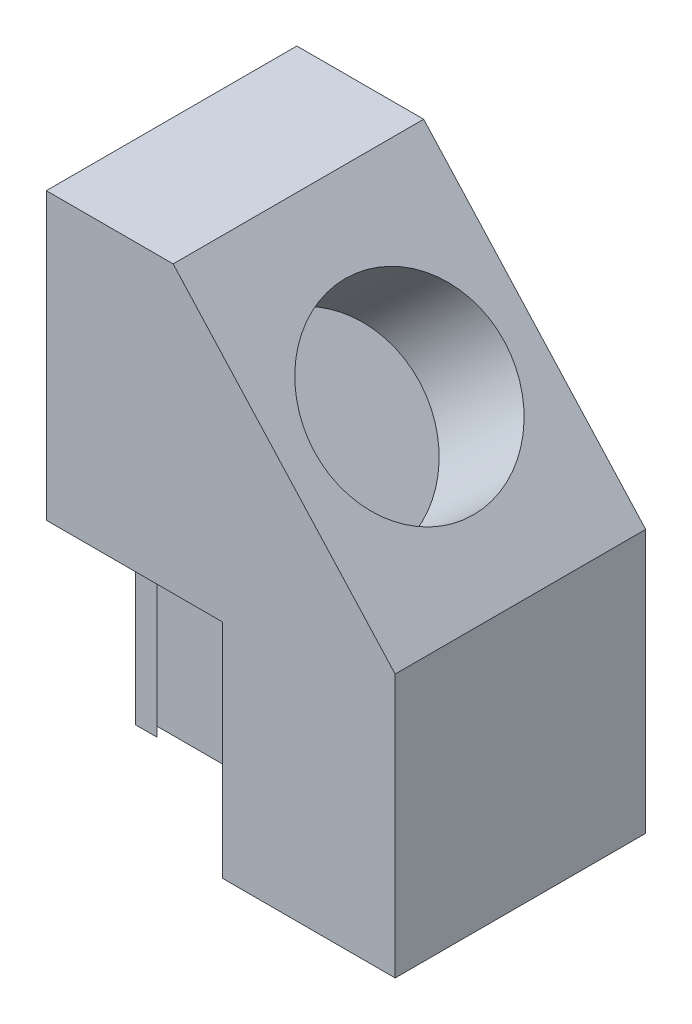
ISO-10303-21;
HEADER;
FILE_DESCRIPTION(('STEP AP214'),'2;1');
FILE_NAME('part.step','',(''),(''),'','','');
FILE_SCHEMA(('AUTOMOTIVE_DESIGN { 1 0 10303 214 1 1 1 1 }'));
ENDSEC;
DATA;
#1=APPLICATION_CONTEXT('core data for automotive mechanical design processes');
#2=APPLICATION_PROTOCOL_DEFINITION('international standard','automotive_design',2000,#1);
#3=PRODUCT_CONTEXT('',#1,'mechanical');
#4=PRODUCT('Part','Part','',(#3));
#5=PRODUCT_RELATED_PRODUCT_CATEGORY('part','',(#4));
#6=PRODUCT_DEFINITION_FORMATION('','',#4);
#7=PRODUCT_DEFINITION_CONTEXT('part definition',#1,'design');
#8=PRODUCT_DEFINITION('design','',#6,#7);
#9=PRODUCT_DEFINITION_SHAPE('','',#8);
#10=(LENGTH_UNIT() NAMED_UNIT(*) SI_UNIT(.MILLI.,.METRE.));
#11=(NAMED_UNIT(*) PLANE_ANGLE_UNIT() SI_UNIT($,.RADIAN.));
#12=(NAMED_UNIT(*) SI_UNIT($,.STERADIAN.) SOLID_ANGLE_UNIT());
#13=UNCERTAINTY_MEASURE_WITH_UNIT(LENGTH_MEASURE(1.E-05),#10,'distance_accuracy_value','');
#14=(GEOMETRIC_REPRESENTATION_CONTEXT(3) GLOBAL_UNCERTAINTY_ASSIGNED_CONTEXT((#13)) GLOBAL_UNIT_ASSIGNED_CONTEXT((#10,
#11,#12)) REPRESENTATION_CONTEXT('',''));
#15=CARTESIAN_POINT('',(0.,0.,0.));
#16=DIRECTION('',(0.,0.,1.));
#17=DIRECTION('',(1.,0.,0.));
#18=AXIS2_PLACEMENT_3D('',#15,#16,#17);
#19=CARTESIAN_POINT('',(0.,88.9,14.351));
#20=DIRECTION('',(0.,0.,-1.));
#21=DIRECTION('',(-1.,0.,0.));
#22=AXIS2_PLACEMENT_3D('',#19,#20,#21);
#23=PLANE('',#22);
#24=DIRECTION('',(1.,0.,0.));
#25=VECTOR('',#24,1.);
#26=CARTESIAN_POINT('',(0.,0.,14.351));
#27=LINE('',#26,#25);
#28=CARTESIAN_POINT('',(0.,0.,14.351));
#29=VERTEX_POINT('',#28);
#30=CARTESIAN_POINT('',(8.61403713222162,0.,14.351));
#31=VERTEX_POINT('',#30);
#32=EDGE_CURVE('E167',#29,#31,#27,.T.);
#33=ORIENTED_EDGE('',*,*,#32,.T.);
#34=DIRECTION('',(0.,-1.,0.));
#35=VECTOR('',#34,1.);
#36=CARTESIAN_POINT('',(8.61403713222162,149.978946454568,14.351));
#37=LINE('',#36,#35);
#38=CARTESIAN_POINT('',(8.61403713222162,88.9,14.351));
#39=VERTEX_POINT('',#38);
#40=EDGE_CURVE('E159',#39,#31,#37,.T.);
#41=ORIENTED_EDGE('',*,*,#40,.F.);
#42=DIRECTION('',(-1.,0.,0.));
#43=VECTOR('',#42,1.);
#44=CARTESIAN_POINT('',(0.,88.9,14.351));
#45=LINE('',#44,#43);
#46=CARTESIAN_POINT('',(0.,88.9,14.351));
#47=VERTEX_POINT('',#46);
#48=EDGE_CURVE('E148',#39,#47,#45,.T.);
#49=ORIENTED_EDGE('',*,*,#48,.T.);
#50=DIRECTION('',(0.,-1.,0.));
#51=VECTOR('',#50,1.);
#52=CARTESIAN_POINT('',(0.,0.,14.351));
#53=LINE('',#52,#51);
#54=EDGE_CURVE('E163',#47,#29,#53,.T.);
#55=ORIENTED_EDGE('',*,*,#54,.T.);
#56=EDGE_LOOP('',(#33,#41,#49,#55));
#57=FACE_BOUND('',#56,.T.);
#58=ADVANCED_FACE('F36',(#57),#23,.F.);
#59=CARTESIAN_POINT('',(0.,203.2,50.165));
#60=DIRECTION('',(1.,0.,0.));
#61=DIRECTION('',(0.,1.,0.));
#62=AXIS2_PLACEMENT_3D('',#59,#60,#61);
#63=PLANE('',#62);
#64=ORIENTED_EDGE('',*,*,#54,.F.);
#65=DIRECTION('',(0.,0.,1.));
#66=VECTOR('',#65,1.);
#67=CARTESIAN_POINT('',(0.,88.9,14.351));
#68=LINE('',#67,#66);
#69=CARTESIAN_POINT('',(0.,88.9,50.165));
#70=VERTEX_POINT('',#69);
#71=EDGE_CURVE('E178',#47,#70,#68,.T.);
#72=ORIENTED_EDGE('',*,*,#71,.T.);
#73=DIRECTION('',(0.,-1.,0.));
#74=VECTOR('',#73,1.);
#75=CARTESIAN_POINT('',(0.,203.2,50.165));
#76=LINE('',#75,#74);
#77=CARTESIAN_POINT('',(0.,203.2,50.165));
#78=VERTEX_POINT('',#77);
#79=EDGE_CURVE('E191',#78,#70,#76,.T.);
#80=ORIENTED_EDGE('',*,*,#79,.F.);
#81=DIRECTION('',(0.,0.,-1.));
#82=VECTOR('',#81,1.);
#83=CARTESIAN_POINT('',(0.,203.2,50.165));
#84=LINE('',#83,#82);
#85=CARTESIAN_POINT('',(0.,203.2,-50.165));
#86=VERTEX_POINT('',#85);
#87=EDGE_CURVE('E203',#78,#86,#84,.T.);
#88=ORIENTED_EDGE('',*,*,#87,.T.);
#89=DIRECTION('',(0.,-1.,0.));
#90=VECTOR('',#89,1.);
#91=CARTESIAN_POINT('',(0.,203.2,-50.165));
#92=LINE('',#91,#90);
#93=CARTESIAN_POINT('',(0.,0.,-50.165));
#94=VERTEX_POINT('',#93);
#95=EDGE_CURVE('E188',#86,#94,#92,.T.);
#96=ORIENTED_EDGE('',*,*,#95,.T.);
#97=DIRECTION('',(0.,0.,-1.));
#98=VECTOR('',#97,1.);
#99=CARTESIAN_POINT('',(0.,0.,50.165));
#100=LINE('',#99,#98);
#101=EDGE_CURVE('E11',#29,#94,#100,.T.);
#102=ORIENTED_EDGE('',*,*,#101,.F.);
#103=EDGE_LOOP('',(#64,#72,#80,#88,#96,#102));
#104=FACE_BOUND('',#103,.T.);
#105=ADVANCED_FACE('F38',(#104),#63,.F.);
#106=CARTESIAN_POINT('',(0.,0.,50.165));
#107=DIRECTION('',(0.,1.,0.));
#108=DIRECTION('',(0.,0.,1.));
#109=AXIS2_PLACEMENT_3D('',#106,#107,#108);
#110=PLANE('',#109);
#111=DIRECTION('',(1.,0.,0.));
#112=VECTOR('',#111,1.);
#113=CARTESIAN_POINT('',(65.7640371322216,0.,10.541));
#114=LINE('',#113,#112);
#115=CARTESIAN_POINT('',(4.80403713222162,0.,10.541));
#116=VERTEX_POINT('',#115);
#117=CARTESIAN_POINT('',(65.7640371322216,0.,10.541));
#118=VERTEX_POINT('',#117);
#119=EDGE_CURVE('E150',#116,#118,#114,.T.);
#120=ORIENTED_EDGE('',*,*,#119,.F.);
#121=DIRECTION('',(-0.707106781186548,0.,-0.707106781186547));
#122=VECTOR('',#121,1.);
#123=CARTESIAN_POINT('',(8.61403713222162,0.,14.351));
#124=LINE('',#123,#122);
#125=EDGE_CURVE('E142',#31,#116,#124,.T.);
#126=ORIENTED_EDGE('',*,*,#125,.F.);
#127=ORIENTED_EDGE('',*,*,#32,.F.);
#128=ORIENTED_EDGE('',*,*,#101,.T.);
#129=DIRECTION('',(1.,0.,0.));
#130=VECTOR('',#129,1.);
#131=CARTESIAN_POINT('',(0.,0.,-50.165));
#132=LINE('',#131,#130);
#133=CARTESIAN_POINT('',(139.7,0.,-50.165));
#134=VERTEX_POINT('',#133);
#135=EDGE_CURVE('E206',#94,#134,#132,.T.);
#136=ORIENTED_EDGE('',*,*,#135,.T.);
#137=DIRECTION('',(0.,0.,-1.));
#138=VECTOR('',#137,1.);
#139=CARTESIAN_POINT('',(139.7,0.,50.165));
#140=LINE('',#139,#138);
#141=CARTESIAN_POINT('',(139.7,0.,50.165));
#142=VERTEX_POINT('',#141);
#143=EDGE_CURVE('E44',#142,#134,#140,.T.);
#144=ORIENTED_EDGE('',*,*,#143,.F.);
#145=DIRECTION('',(1.,0.,0.));
#146=VECTOR('',#145,1.);
#147=CARTESIAN_POINT('',(0.,0.,50.165));
#148=LINE('',#147,#146);
#149=CARTESIAN_POINT('',(70.5680742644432,0.,50.165));
#150=VERTEX_POINT('',#149);
#151=EDGE_CURVE('E194',#150,#142,#148,.T.);
#152=ORIENTED_EDGE('',*,*,#151,.F.);
#153=DIRECTION('',(0.,0.,1.));
#154=VECTOR('',#153,1.);
#155=CARTESIAN_POINT('',(70.5680742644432,0.,14.351));
#156=LINE('',#155,#154);
#157=CARTESIAN_POINT('',(70.5680742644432,0.,14.351));
#158=VERTEX_POINT('',#157);
#159=EDGE_CURVE('E59',#158,#150,#156,.T.);
#160=ORIENTED_EDGE('',*,*,#159,.F.);
#161=CARTESIAN_POINT('',(61.9540371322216,0.,14.351));
#162=VERTEX_POINT('',#161);
#163=EDGE_CURVE('E165',#162,#158,#27,.T.);
#164=ORIENTED_EDGE('',*,*,#163,.F.);
#165=DIRECTION('',(-0.707106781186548,0.,0.707106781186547));
#166=VECTOR('',#165,1.);
#167=CARTESIAN_POINT('',(61.9540371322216,0.,14.351));
#168=LINE('',#167,#166);
#169=EDGE_CURVE('E51',#118,#162,#168,.T.);
#170=ORIENTED_EDGE('',*,*,#169,.F.);
#171=EDGE_LOOP('',(#120,#126,#127,#128,#136,#144,#152,#160,#164,#170));
#172=FACE_BOUND('',#171,.T.);
#173=ADVANCED_FACE('F247',(#172),#110,.F.);
#174=CARTESIAN_POINT('',(139.7,105.41,50.165));
#175=DIRECTION('',(-1.,0.,0.));
#176=DIRECTION('',(0.,0.,1.));
#177=AXIS2_PLACEMENT_3D('',#174,#175,#176);
#178=PLANE('',#177);
#179=DIRECTION('',(0.,1.,0.));
#180=VECTOR('',#179,1.);
#181=CARTESIAN_POINT('',(139.7,105.41,-50.165));
#182=LINE('',#181,#180);
#183=CARTESIAN_POINT('',(139.7,105.41,-50.165));
#184=VERTEX_POINT('',#183);
#185=EDGE_CURVE('E208',#134,#184,#182,.T.);
#186=ORIENTED_EDGE('',*,*,#185,.T.);
#187=DIRECTION('',(0.,0.,-1.));
#188=VECTOR('',#187,1.);
#189=CARTESIAN_POINT('',(139.7,105.41,50.165));
#190=LINE('',#189,#188);
#191=CARTESIAN_POINT('',(139.7,105.41,50.165));
#192=VERTEX_POINT('',#191);
#193=EDGE_CURVE('E218',#192,#184,#190,.T.);
#194=ORIENTED_EDGE('',*,*,#193,.F.);
#195=DIRECTION('',(0.,1.,0.));
#196=VECTOR('',#195,1.);
#197=CARTESIAN_POINT('',(139.7,105.41,50.165));
#198=LINE('',#197,#196);
#199=EDGE_CURVE('E197',#142,#192,#198,.T.);
#200=ORIENTED_EDGE('',*,*,#199,.F.);
#201=ORIENTED_EDGE('',*,*,#143,.T.);
#202=EDGE_LOOP('',(#186,#194,#200,#201));
#203=FACE_BOUND('',#202,.T.);
#204=ADVANCED_FACE('F225',(#203),#178,.F.);
#205=CARTESIAN_POINT('',(50.8,203.2,50.165));
#206=DIRECTION('',(-0.739940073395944,-0.672672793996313,0.));
#207=DIRECTION('',(0.672672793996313,-0.739940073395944,0.));
#208=AXIS2_PLACEMENT_3D('',#205,#206,#207);
#209=PLANE('',#208);
#210=CARTESIAN_POINT('',(95.25,154.305,0.));
#211=DIRECTION('',(0.739940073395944,0.672672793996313,0.));
#212=DIRECTION('',(-0.672672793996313,0.739940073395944,0.));
#213=AXIS2_PLACEMENT_3D('',#210,#211,#212);
#214=CIRCLE('',#213,38.1);
#215=CARTESIAN_POINT('',(69.6211665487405,182.496716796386,0.));
#216=VERTEX_POINT('',#215);
#217=EDGE_CURVE('E181',#216,#216,#214,.T.);
#218=ORIENTED_EDGE('',*,*,#217,.F.);
#219=EDGE_LOOP('',(#218));
#220=FACE_BOUND('',#219,.T.);
#221=DIRECTION('',(-0.672672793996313,0.739940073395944,0.));
#222=VECTOR('',#221,1.);
#223=CARTESIAN_POINT('',(50.8,203.2,-50.165));
#224=LINE('',#223,#222);
#225=CARTESIAN_POINT('',(50.8,203.2,-50.165));
#226=VERTEX_POINT('',#225);
#227=EDGE_CURVE('E210',#184,#226,#224,.T.);
#228=ORIENTED_EDGE('',*,*,#227,.T.);
#229=DIRECTION('',(0.,0.,-1.));
#230=VECTOR('',#229,1.);
#231=CARTESIAN_POINT('',(50.8,203.2,50.165));
#232=LINE('',#231,#230);
#233=CARTESIAN_POINT('',(50.8,203.2,50.165));
#234=VERTEX_POINT('',#233);
#235=EDGE_CURVE('E215',#234,#226,#232,.T.);
#236=ORIENTED_EDGE('',*,*,#235,.F.);
#237=DIRECTION('',(-0.672672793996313,0.739940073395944,0.));
#238=VECTOR('',#237,1.);
#239=CARTESIAN_POINT('',(50.8,203.2,50.165));
#240=LINE('',#239,#238);
#241=EDGE_CURVE('E199',#192,#234,#240,.T.);
#242=ORIENTED_EDGE('',*,*,#241,.F.);
#243=ORIENTED_EDGE('',*,*,#193,.T.);
#244=EDGE_LOOP('',(#228,#236,#242,#243));
#245=FACE_BOUND('',#244,.T.);
#246=ADVANCED_FACE('F237',(#220,#245),#209,.F.);
#247=CARTESIAN_POINT('',(0.,203.2,50.165));
#248=DIRECTION('',(0.,-1.,0.));
#249=DIRECTION('',(0.,0.,-1.));
#250=AXIS2_PLACEMENT_3D('',#247,#248,#249);
#251=PLANE('',#250);
#252=DIRECTION('',(-1.,0.,0.));
#253=VECTOR('',#252,1.);
#254=CARTESIAN_POINT('',(0.,203.2,-50.165));
#255=LINE('',#254,#253);
#256=EDGE_CURVE('E195',#226,#86,#255,.T.);
#257=ORIENTED_EDGE('',*,*,#256,.T.);
#258=ORIENTED_EDGE('',*,*,#87,.F.);
#259=DIRECTION('',(-1.,0.,0.));
#260=VECTOR('',#259,1.);
#261=CARTESIAN_POINT('',(0.,203.2,50.165));
#262=LINE('',#261,#260);
#263=EDGE_CURVE('E201',#234,#78,#262,.T.);
#264=ORIENTED_EDGE('',*,*,#263,.F.);
#265=ORIENTED_EDGE('',*,*,#235,.T.);
#266=EDGE_LOOP('',(#257,#258,#264,#265));
#267=FACE_BOUND('',#266,.T.);
#268=ADVANCED_FACE('F241',(#267),#251,.F.);
#269=CARTESIAN_POINT('',(0.,0.,50.165));
#270=DIRECTION('',(0.,0.,1.));
#271=DIRECTION('',(1.,0.,0.));
#272=AXIS2_PLACEMENT_3D('',#269,#270,#271);
#273=PLANE('',#272);
#274=DIRECTION('',(-1.,0.,0.));
#275=VECTOR('',#274,1.);
#276=CARTESIAN_POINT('',(0.,88.9,50.165));
#277=LINE('',#276,#275);
#278=CARTESIAN_POINT('',(70.5680742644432,88.9,50.165));
#279=VERTEX_POINT('',#278);
#280=EDGE_CURVE('E166',#279,#70,#277,.T.);
#281=ORIENTED_EDGE('',*,*,#280,.F.);
#282=DIRECTION('',(0.,1.,0.));
#283=VECTOR('',#282,1.);
#284=CARTESIAN_POINT('',(70.5680742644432,0.,50.165));
#285=LINE('',#284,#283);
#286=EDGE_CURVE('E162',#150,#279,#285,.T.);
#287=ORIENTED_EDGE('',*,*,#286,.F.);
#288=ORIENTED_EDGE('',*,*,#151,.T.);
#289=ORIENTED_EDGE('',*,*,#199,.T.);
#290=ORIENTED_EDGE('',*,*,#241,.T.);
#291=ORIENTED_EDGE('',*,*,#263,.T.);
#292=ORIENTED_EDGE('',*,*,#79,.T.);
#293=EDGE_LOOP('',(#281,#287,#288,#289,#290,#291,#292));
#294=FACE_BOUND('',#293,.T.);
#295=ADVANCED_FACE('F246',(#294),#273,.T.);
#296=CARTESIAN_POINT('',(0.,0.,-50.165));
#297=DIRECTION('',(0.,0.,1.));
#298=DIRECTION('',(1.,0.,0.));
#299=AXIS2_PLACEMENT_3D('',#296,#297,#298);
#300=PLANE('',#299);
#301=ORIENTED_EDGE('',*,*,#95,.F.);
#302=ORIENTED_EDGE('',*,*,#256,.F.);
#303=ORIENTED_EDGE('',*,*,#227,.F.);
#304=ORIENTED_EDGE('',*,*,#185,.F.);
#305=ORIENTED_EDGE('',*,*,#135,.F.);
#306=EDGE_LOOP('',(#301,#302,#303,#304,#305));
#307=FACE_BOUND('',#306,.T.);
#308=ADVANCED_FACE('F233',(#307),#300,.F.);
#309=CARTESIAN_POINT('',(61.2319950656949,123.379540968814,0.));
#310=DIRECTION('',(0.739940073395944,0.672672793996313,0.));
#311=DIRECTION('',(-0.672672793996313,0.739940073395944,0.));
#312=AXIS2_PLACEMENT_3D('',#309,#310,#311);
#313=CYLINDRICAL_SURFACE('',#312,38.1);
#314=CARTESIAN_POINT('',(61.2319950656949,123.379540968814,0.));
#315=DIRECTION('',(0.739940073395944,0.672672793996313,0.));
#316=DIRECTION('',(-0.672672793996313,0.739940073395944,0.));
#317=AXIS2_PLACEMENT_3D('',#314,#315,#316);
#318=CIRCLE('',#317,38.1);
#319=CARTESIAN_POINT('',(35.6031616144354,151.571257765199,0.));
#320=VERTEX_POINT('',#319);
#321=EDGE_CURVE('E185',#320,#320,#318,.T.);
#322=ORIENTED_EDGE('',*,*,#321,.F.);
#323=EDGE_LOOP('',(#322));
#324=FACE_BOUND('',#323,.T.);
#325=ORIENTED_EDGE('',*,*,#217,.T.);
#326=EDGE_LOOP('',(#325));
#327=FACE_BOUND('',#326,.T.);
#328=ADVANCED_FACE('F282',(#324,#327),#313,.F.);
#329=CARTESIAN_POINT('',(61.2319950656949,123.379540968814,0.));
#330=DIRECTION('',(0.739940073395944,0.672672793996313,0.));
#331=DIRECTION('',(-0.672672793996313,0.739940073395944,0.));
#332=AXIS2_PLACEMENT_3D('',#329,#330,#331);
#333=PLANE('',#332);
#334=ORIENTED_EDGE('',*,*,#321,.T.);
#335=EDGE_LOOP('',(#334));
#336=FACE_BOUND('',#335,.T.);
#337=ADVANCED_FACE('F278',(#336),#333,.T.);
#338=CARTESIAN_POINT('',(0.,88.9,14.351));
#339=DIRECTION('',(0.,1.,0.));
#340=DIRECTION('',(0.,0.,1.));
#341=AXIS2_PLACEMENT_3D('',#338,#339,#340);
#342=PLANE('',#341);
#343=ORIENTED_EDGE('',*,*,#280,.T.);
#344=ORIENTED_EDGE('',*,*,#71,.F.);
#345=ORIENTED_EDGE('',*,*,#48,.F.);
#346=DIRECTION('',(-0.707106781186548,0.,-0.707106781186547));
#347=VECTOR('',#346,1.);
#348=CARTESIAN_POINT('',(8.61403713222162,88.9,14.351));
#349=LINE('',#348,#347);
#350=CARTESIAN_POINT('',(4.80403713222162,88.9,10.541));
#351=VERTEX_POINT('',#350);
#352=EDGE_CURVE('E139',#39,#351,#349,.T.);
#353=ORIENTED_EDGE('',*,*,#352,.T.);
#354=DIRECTION('',(1.,0.,0.));
#355=VECTOR('',#354,1.);
#356=CARTESIAN_POINT('',(65.7640371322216,88.9,10.541));
#357=LINE('',#356,#355);
#358=CARTESIAN_POINT('',(65.7640371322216,88.9,10.541));
#359=VERTEX_POINT('',#358);
#360=EDGE_CURVE('E126',#351,#359,#357,.T.);
#361=ORIENTED_EDGE('',*,*,#360,.T.);
#362=DIRECTION('',(-0.707106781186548,0.,0.707106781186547));
#363=VECTOR('',#362,1.);
#364=CARTESIAN_POINT('',(61.9540371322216,88.9,14.351));
#365=LINE('',#364,#363);
#366=CARTESIAN_POINT('',(61.9540371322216,88.9,14.351));
#367=VERTEX_POINT('',#366);
#368=EDGE_CURVE('E155',#359,#367,#365,.T.);
#369=ORIENTED_EDGE('',*,*,#368,.T.);
#370=CARTESIAN_POINT('',(70.5680742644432,88.9,14.351));
#371=VERTEX_POINT('',#370);
#372=EDGE_CURVE('E173',#371,#367,#45,.T.);
#373=ORIENTED_EDGE('',*,*,#372,.F.);
#374=DIRECTION('',(0.,0.,1.));
#375=VECTOR('',#374,1.);
#376=CARTESIAN_POINT('',(70.5680742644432,88.9,14.351));
#377=LINE('',#376,#375);
#378=EDGE_CURVE('E182',#371,#279,#377,.T.);
#379=ORIENTED_EDGE('',*,*,#378,.T.);
#380=EDGE_LOOP('',(#343,#344,#345,#353,#361,#369,#373,#379));
#381=FACE_BOUND('',#380,.T.);
#382=ADVANCED_FACE('F146',(#381),#342,.F.);
#383=CARTESIAN_POINT('',(70.5680742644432,0.,14.351));
#384=DIRECTION('',(1.,0.,0.));
#385=DIRECTION('',(0.,0.,-1.));
#386=AXIS2_PLACEMENT_3D('',#383,#384,#385);
#387=PLANE('',#386);
#388=ORIENTED_EDGE('',*,*,#286,.T.);
#389=ORIENTED_EDGE('',*,*,#378,.F.);
#390=DIRECTION('',(0.,1.,0.));
#391=VECTOR('',#390,1.);
#392=CARTESIAN_POINT('',(70.5680742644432,0.,14.351));
#393=LINE('',#392,#391);
#394=EDGE_CURVE('E170',#158,#371,#393,.T.);
#395=ORIENTED_EDGE('',*,*,#394,.F.);
#396=ORIENTED_EDGE('',*,*,#159,.T.);
#397=EDGE_LOOP('',(#388,#389,#395,#396));
#398=FACE_BOUND('',#397,.T.);
#399=ADVANCED_FACE('F252',(#398),#387,.F.);
#400=ORIENTED_EDGE('',*,*,#372,.T.);
#401=DIRECTION('',(0.,-1.,0.));
#402=VECTOR('',#401,1.);
#403=CARTESIAN_POINT('',(61.9540371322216,149.978946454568,14.351));
#404=LINE('',#403,#402);
#405=EDGE_CURVE('E156',#367,#162,#404,.T.);
#406=ORIENTED_EDGE('',*,*,#405,.T.);
#407=ORIENTED_EDGE('',*,*,#163,.T.);
#408=ORIENTED_EDGE('',*,*,#394,.T.);
#409=EDGE_LOOP('',(#400,#406,#407,#408));
#410=FACE_BOUND('',#409,.T.);
#411=ADVANCED_FACE('F250',(#410),#23,.F.);
#412=CARTESIAN_POINT('',(8.61403713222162,149.978946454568,14.351));
#413=DIRECTION('',(-0.707106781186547,0.,0.707106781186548));
#414=DIRECTION('',(0.707106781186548,0.,0.707106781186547));
#415=AXIS2_PLACEMENT_3D('',#412,#413,#414);
#416=PLANE('',#415);
#417=ORIENTED_EDGE('',*,*,#40,.T.);
#418=ORIENTED_EDGE('',*,*,#125,.T.);
#419=DIRECTION('',(0.,-1.,0.));
#420=VECTOR('',#419,1.);
#421=CARTESIAN_POINT('',(4.80403713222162,149.978946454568,10.541));
#422=LINE('',#421,#420);
#423=EDGE_CURVE('E130',#351,#116,#422,.T.);
#424=ORIENTED_EDGE('',*,*,#423,.F.);
#425=ORIENTED_EDGE('',*,*,#352,.F.);
#426=EDGE_LOOP('',(#417,#418,#424,#425));
#427=FACE_BOUND('',#426,.T.);
#428=ADVANCED_FACE('F138',(#427),#416,.F.);
#429=CARTESIAN_POINT('',(65.7640371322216,149.978946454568,10.541));
#430=DIRECTION('',(0.,0.,-1.));
#431=DIRECTION('',(-1.,0.,0.));
#432=AXIS2_PLACEMENT_3D('',#429,#430,#431);
#433=PLANE('',#432);
#434=ORIENTED_EDGE('',*,*,#423,.T.);
#435=ORIENTED_EDGE('',*,*,#119,.T.);
#436=DIRECTION('',(0.,-1.,0.));
#437=VECTOR('',#436,1.);
#438=CARTESIAN_POINT('',(65.7640371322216,149.978946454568,10.541));
#439=LINE('',#438,#437);
#440=EDGE_CURVE('E132',#359,#118,#439,.T.);
#441=ORIENTED_EDGE('',*,*,#440,.F.);
#442=ORIENTED_EDGE('',*,*,#360,.F.);
#443=EDGE_LOOP('',(#434,#435,#441,#442));
#444=FACE_BOUND('',#443,.T.);
#445=ADVANCED_FACE('F128',(#444),#433,.F.);
#446=CARTESIAN_POINT('',(61.9540371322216,149.978946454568,14.351));
#447=DIRECTION('',(0.707106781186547,0.,0.707106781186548));
#448=DIRECTION('',(0.707106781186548,0.,-0.707106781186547));
#449=AXIS2_PLACEMENT_3D('',#446,#447,#448);
#450=PLANE('',#449);
#451=ORIENTED_EDGE('',*,*,#440,.T.);
#452=ORIENTED_EDGE('',*,*,#169,.T.);
#453=ORIENTED_EDGE('',*,*,#405,.F.);
#454=ORIENTED_EDGE('',*,*,#368,.F.);
#455=EDGE_LOOP('',(#451,#452,#453,#454));
#456=FACE_BOUND('',#455,.T.);
#457=ADVANCED_FACE('F253',(#456),#450,.F.);
#458=CLOSED_SHELL('',(#58,#105,#173,#204,#246,#268,#295,#308,#328,#337,#382,#399,#411,#428,#445,#457));
#459=MANIFOLD_SOLID_BREP('B2',#458);
#460=ADVANCED_BREP_SHAPE_REPRESENTATION('',(#18,#459),#14);
#461=SHAPE_DEFINITION_REPRESENTATION(#9,#460);
ENDSEC;
END-ISO-10303-21;
